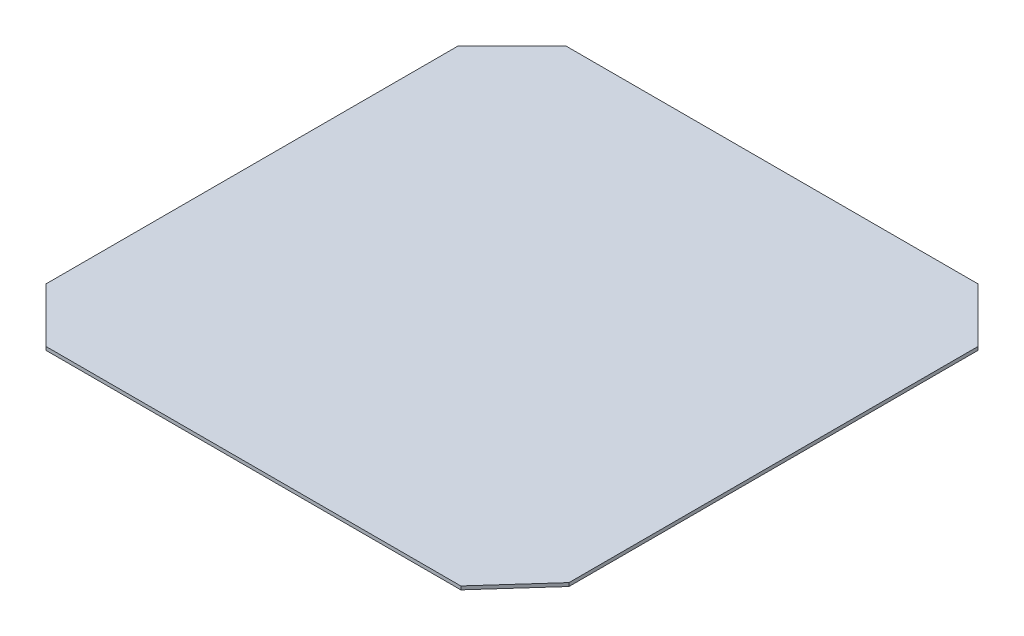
ISO-10303-21;
HEADER;
FILE_DESCRIPTION(('STEP AP214'),'2;1');
FILE_NAME('part.step','',(''),(''),'','','');
FILE_SCHEMA(('AUTOMOTIVE_DESIGN { 1 0 10303 214 1 1 1 1 }'));
ENDSEC;
DATA;
#1=APPLICATION_CONTEXT('core data for automotive mechanical design processes');
#2=APPLICATION_PROTOCOL_DEFINITION('international standard','automotive_design',2000,#1);
#3=PRODUCT_CONTEXT('',#1,'mechanical');
#4=PRODUCT('Part','Part','',(#3));
#5=PRODUCT_RELATED_PRODUCT_CATEGORY('part','',(#4));
#6=PRODUCT_DEFINITION_FORMATION('','',#4);
#7=PRODUCT_DEFINITION_CONTEXT('part definition',#1,'design');
#8=PRODUCT_DEFINITION('design','',#6,#7);
#9=PRODUCT_DEFINITION_SHAPE('','',#8);
#10=(LENGTH_UNIT() NAMED_UNIT(*) SI_UNIT(.MILLI.,.METRE.));
#11=(NAMED_UNIT(*) PLANE_ANGLE_UNIT() SI_UNIT($,.RADIAN.));
#12=(NAMED_UNIT(*) SI_UNIT($,.STERADIAN.) SOLID_ANGLE_UNIT());
#13=UNCERTAINTY_MEASURE_WITH_UNIT(LENGTH_MEASURE(1.E-05),#10,'distance_accuracy_value','');
#14=(GEOMETRIC_REPRESENTATION_CONTEXT(3) GLOBAL_UNCERTAINTY_ASSIGNED_CONTEXT((#13)) GLOBAL_UNIT_ASSIGNED_CONTEXT((#10,
#11,#12)) REPRESENTATION_CONTEXT('',''));
#15=CARTESIAN_POINT('',(0.,0.,0.));
#16=DIRECTION('',(0.,0.,1.));
#17=DIRECTION('',(1.,0.,0.));
#18=AXIS2_PLACEMENT_3D('',#15,#16,#17);
#19=CARTESIAN_POINT('',(244.787268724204,4.,304.8));
#20=DIRECTION('',(-0.743915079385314,0.,-0.668274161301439));
#21=DIRECTION('',(-0.668274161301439,0.,0.743915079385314));
#22=AXIS2_PLACEMENT_3D('',#19,#20,#21);
#23=PLANE('',#22);
#24=DIRECTION('',(0.668274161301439,0.,-0.743915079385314));
#25=VECTOR('',#24,1.);
#26=CARTESIAN_POINT('',(244.787268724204,0.,304.8));
#27=LINE('',#26,#25);
#28=CARTESIAN_POINT('',(244.787268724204,0.,304.8));
#29=VERTEX_POINT('',#28);
#30=CARTESIAN_POINT('',(304.8,0.,237.994520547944));
#31=VERTEX_POINT('',#30);
#32=EDGE_CURVE('E148',#29,#31,#27,.T.);
#33=ORIENTED_EDGE('',*,*,#32,.T.);
#34=DIRECTION('',(0.,-1.,0.));
#35=VECTOR('',#34,1.);
#36=CARTESIAN_POINT('',(304.8,4.,237.994520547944));
#37=LINE('',#36,#35);
#38=CARTESIAN_POINT('',(304.8,4.,237.994520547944));
#39=VERTEX_POINT('',#38);
#40=EDGE_CURVE('E11',#39,#31,#37,.T.);
#41=ORIENTED_EDGE('',*,*,#40,.F.);
#42=DIRECTION('',(0.668274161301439,0.,-0.743915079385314));
#43=VECTOR('',#42,1.);
#44=CARTESIAN_POINT('',(244.787268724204,4.,304.8));
#45=LINE('',#44,#43);
#46=CARTESIAN_POINT('',(244.787268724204,4.,304.8));
#47=VERTEX_POINT('',#46);
#48=EDGE_CURVE('E170',#47,#39,#45,.T.);
#49=ORIENTED_EDGE('',*,*,#48,.F.);
#50=DIRECTION('',(0.,-1.,0.));
#51=VECTOR('',#50,1.);
#52=CARTESIAN_POINT('',(244.787268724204,4.,304.8));
#53=LINE('',#52,#51);
#54=EDGE_CURVE('E144',#47,#29,#53,.T.);
#55=ORIENTED_EDGE('',*,*,#54,.T.);
#56=EDGE_LOOP('',(#33,#41,#49,#55));
#57=FACE_BOUND('',#56,.T.);
#58=ADVANCED_FACE('F47',(#57),#23,.F.);
#59=CARTESIAN_POINT('',(304.8,4.,237.994520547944));
#60=DIRECTION('',(-1.,0.,0.));
#61=DIRECTION('',(0.,0.,1.));
#62=AXIS2_PLACEMENT_3D('',#59,#60,#61);
#63=PLANE('',#62);
#64=DIRECTION('',(0.,0.,-1.));
#65=VECTOR('',#64,1.);
#66=CARTESIAN_POINT('',(304.8,0.,237.994520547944));
#67=LINE('',#66,#65);
#68=CARTESIAN_POINT('',(304.8,0.,-241.3));
#69=VERTEX_POINT('',#68);
#70=EDGE_CURVE('E152',#31,#69,#67,.T.);
#71=ORIENTED_EDGE('',*,*,#70,.T.);
#72=DIRECTION('',(0.,-1.,0.));
#73=VECTOR('',#72,1.);
#74=CARTESIAN_POINT('',(304.8,4.,-241.3));
#75=LINE('',#74,#73);
#76=CARTESIAN_POINT('',(304.8,4.,-241.3));
#77=VERTEX_POINT('',#76);
#78=EDGE_CURVE('E56',#77,#69,#75,.T.);
#79=ORIENTED_EDGE('',*,*,#78,.F.);
#80=DIRECTION('',(0.,0.,-1.));
#81=VECTOR('',#80,1.);
#82=CARTESIAN_POINT('',(304.8,4.,237.994520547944));
#83=LINE('',#82,#81);
#84=EDGE_CURVE('E107',#39,#77,#83,.T.);
#85=ORIENTED_EDGE('',*,*,#84,.F.);
#86=ORIENTED_EDGE('',*,*,#40,.T.);
#87=EDGE_LOOP('',(#71,#79,#85,#86));
#88=FACE_BOUND('',#87,.T.);
#89=ADVANCED_FACE('F216',(#88),#63,.F.);
#90=CARTESIAN_POINT('',(304.8,4.,-241.3));
#91=DIRECTION('',(-0.707106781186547,0.,0.707106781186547));
#92=DIRECTION('',(0.707106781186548,0.,0.707106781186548));
#93=AXIS2_PLACEMENT_3D('',#90,#91,#92);
#94=PLANE('',#93);
#95=DIRECTION('',(-0.707106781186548,0.,-0.707106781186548));
#96=VECTOR('',#95,1.);
#97=CARTESIAN_POINT('',(304.8,0.,-241.3));
#98=LINE('',#97,#96);
#99=CARTESIAN_POINT('',(241.3,0.,-304.8));
#100=VERTEX_POINT('',#99);
#101=EDGE_CURVE('E155',#69,#100,#98,.T.);
#102=ORIENTED_EDGE('',*,*,#101,.T.);
#103=DIRECTION('',(0.,-1.,0.));
#104=VECTOR('',#103,1.);
#105=CARTESIAN_POINT('',(241.3,4.,-304.8));
#106=LINE('',#105,#104);
#107=CARTESIAN_POINT('',(241.3,4.,-304.8));
#108=VERTEX_POINT('',#107);
#109=EDGE_CURVE('E181',#108,#100,#106,.T.);
#110=ORIENTED_EDGE('',*,*,#109,.F.);
#111=DIRECTION('',(-0.707106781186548,0.,-0.707106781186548));
#112=VECTOR('',#111,1.);
#113=CARTESIAN_POINT('',(304.8,4.,-241.3));
#114=LINE('',#113,#112);
#115=EDGE_CURVE('E191',#77,#108,#114,.T.);
#116=ORIENTED_EDGE('',*,*,#115,.F.);
#117=ORIENTED_EDGE('',*,*,#78,.T.);
#118=EDGE_LOOP('',(#102,#110,#116,#117));
#119=FACE_BOUND('',#118,.T.);
#120=ADVANCED_FACE('F189',(#119),#94,.F.);
#121=CARTESIAN_POINT('',(241.3,4.,-304.8));
#122=DIRECTION('',(0.,0.,1.));
#123=DIRECTION('',(1.,0.,0.));
#124=AXIS2_PLACEMENT_3D('',#121,#122,#123);
#125=PLANE('',#124);
#126=DIRECTION('',(-1.,0.,0.));
#127=VECTOR('',#126,1.);
#128=CARTESIAN_POINT('',(241.3,0.,-304.8));
#129=LINE('',#128,#127);
#130=CARTESIAN_POINT('',(-241.3,0.,-304.8));
#131=VERTEX_POINT('',#130);
#132=EDGE_CURVE('E158',#100,#131,#129,.T.);
#133=ORIENTED_EDGE('',*,*,#132,.T.);
#134=DIRECTION('',(0.,-1.,0.));
#135=VECTOR('',#134,1.);
#136=CARTESIAN_POINT('',(-241.3,4.,-304.8));
#137=LINE('',#136,#135);
#138=CARTESIAN_POINT('',(-241.3,4.,-304.8));
#139=VERTEX_POINT('',#138);
#140=EDGE_CURVE('E177',#139,#131,#137,.T.);
#141=ORIENTED_EDGE('',*,*,#140,.F.);
#142=DIRECTION('',(-1.,0.,0.));
#143=VECTOR('',#142,1.);
#144=CARTESIAN_POINT('',(241.3,4.,-304.8));
#145=LINE('',#144,#143);
#146=EDGE_CURVE('E204',#108,#139,#145,.T.);
#147=ORIENTED_EDGE('',*,*,#146,.F.);
#148=ORIENTED_EDGE('',*,*,#109,.T.);
#149=EDGE_LOOP('',(#133,#141,#147,#148));
#150=FACE_BOUND('',#149,.T.);
#151=ADVANCED_FACE('F199',(#150),#125,.F.);
#152=CARTESIAN_POINT('',(-241.3,4.,-304.8));
#153=DIRECTION('',(0.707106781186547,0.,0.707106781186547));
#154=DIRECTION('',(0.707106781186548,0.,-0.707106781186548));
#155=AXIS2_PLACEMENT_3D('',#152,#153,#154);
#156=PLANE('',#155);
#157=DIRECTION('',(-0.707106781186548,0.,0.707106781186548));
#158=VECTOR('',#157,1.);
#159=CARTESIAN_POINT('',(-241.3,0.,-304.8));
#160=LINE('',#159,#158);
#161=CARTESIAN_POINT('',(-304.8,0.,-241.3));
#162=VERTEX_POINT('',#161);
#163=EDGE_CURVE('E161',#131,#162,#160,.T.);
#164=ORIENTED_EDGE('',*,*,#163,.T.);
#165=DIRECTION('',(0.,-1.,0.));
#166=VECTOR('',#165,1.);
#167=CARTESIAN_POINT('',(-304.8,4.,-241.3));
#168=LINE('',#167,#166);
#169=CARTESIAN_POINT('',(-304.8,4.,-241.3));
#170=VERTEX_POINT('',#169);
#171=EDGE_CURVE('E137',#170,#162,#168,.T.);
#172=ORIENTED_EDGE('',*,*,#171,.F.);
#173=DIRECTION('',(-0.707106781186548,0.,0.707106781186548));
#174=VECTOR('',#173,1.);
#175=CARTESIAN_POINT('',(-241.3,4.,-304.8));
#176=LINE('',#175,#174);
#177=EDGE_CURVE('E126',#139,#170,#176,.T.);
#178=ORIENTED_EDGE('',*,*,#177,.F.);
#179=ORIENTED_EDGE('',*,*,#140,.T.);
#180=EDGE_LOOP('',(#164,#172,#178,#179));
#181=FACE_BOUND('',#180,.T.);
#182=ADVANCED_FACE('F202',(#181),#156,.F.);
#183=CARTESIAN_POINT('',(-304.8,4.,-241.3));
#184=DIRECTION('',(1.,0.,0.));
#185=DIRECTION('',(0.,0.,-1.));
#186=AXIS2_PLACEMENT_3D('',#183,#184,#185);
#187=PLANE('',#186);
#188=DIRECTION('',(0.,0.,1.));
#189=VECTOR('',#188,1.);
#190=CARTESIAN_POINT('',(-304.8,0.,-241.3));
#191=LINE('',#190,#189);
#192=CARTESIAN_POINT('',(-304.8,0.,241.3));
#193=VERTEX_POINT('',#192);
#194=EDGE_CURVE('E135',#162,#193,#191,.T.);
#195=ORIENTED_EDGE('',*,*,#194,.T.);
#196=DIRECTION('',(0.,-1.,0.));
#197=VECTOR('',#196,1.);
#198=CARTESIAN_POINT('',(-304.8,4.,241.3));
#199=LINE('',#198,#197);
#200=CARTESIAN_POINT('',(-304.8,4.,241.3));
#201=VERTEX_POINT('',#200);
#202=EDGE_CURVE('E132',#201,#193,#199,.T.);
#203=ORIENTED_EDGE('',*,*,#202,.F.);
#204=DIRECTION('',(0.,0.,1.));
#205=VECTOR('',#204,1.);
#206=CARTESIAN_POINT('',(-304.8,4.,-241.3));
#207=LINE('',#206,#205);
#208=EDGE_CURVE('E120',#170,#201,#207,.T.);
#209=ORIENTED_EDGE('',*,*,#208,.F.);
#210=ORIENTED_EDGE('',*,*,#171,.T.);
#211=EDGE_LOOP('',(#195,#203,#209,#210));
#212=FACE_BOUND('',#211,.T.);
#213=ADVANCED_FACE('F133',(#212),#187,.F.);
#214=CARTESIAN_POINT('',(-304.8,4.,241.3));
#215=DIRECTION('',(0.707106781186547,0.,-0.707106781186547));
#216=DIRECTION('',(-0.707106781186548,0.,-0.707106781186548));
#217=AXIS2_PLACEMENT_3D('',#214,#215,#216);
#218=PLANE('',#217);
#219=DIRECTION('',(0.707106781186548,0.,0.707106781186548));
#220=VECTOR('',#219,1.);
#221=CARTESIAN_POINT('',(-304.8,0.,241.3));
#222=LINE('',#221,#220);
#223=CARTESIAN_POINT('',(-241.3,0.,304.8));
#224=VERTEX_POINT('',#223);
#225=EDGE_CURVE('E93',#193,#224,#222,.T.);
#226=ORIENTED_EDGE('',*,*,#225,.T.);
#227=DIRECTION('',(0.,-1.,0.));
#228=VECTOR('',#227,1.);
#229=CARTESIAN_POINT('',(-241.3,4.,304.8));
#230=LINE('',#229,#228);
#231=CARTESIAN_POINT('',(-241.3,4.,304.8));
#232=VERTEX_POINT('',#231);
#233=EDGE_CURVE('E138',#232,#224,#230,.T.);
#234=ORIENTED_EDGE('',*,*,#233,.F.);
#235=DIRECTION('',(0.707106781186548,0.,0.707106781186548));
#236=VECTOR('',#235,1.);
#237=CARTESIAN_POINT('',(-304.8,4.,241.3));
#238=LINE('',#237,#236);
#239=EDGE_CURVE('E124',#201,#232,#238,.T.);
#240=ORIENTED_EDGE('',*,*,#239,.F.);
#241=ORIENTED_EDGE('',*,*,#202,.T.);
#242=EDGE_LOOP('',(#226,#234,#240,#241));
#243=FACE_BOUND('',#242,.T.);
#244=ADVANCED_FACE('F140',(#243),#218,.F.);
#245=CARTESIAN_POINT('',(-241.3,4.,304.8));
#246=DIRECTION('',(0.,0.,-1.));
#247=DIRECTION('',(-1.,0.,0.));
#248=AXIS2_PLACEMENT_3D('',#245,#246,#247);
#249=PLANE('',#248);
#250=DIRECTION('',(1.,0.,0.));
#251=VECTOR('',#250,1.);
#252=CARTESIAN_POINT('',(-241.3,0.,304.8));
#253=LINE('',#252,#251);
#254=EDGE_CURVE('E99',#224,#29,#253,.T.);
#255=ORIENTED_EDGE('',*,*,#254,.T.);
#256=ORIENTED_EDGE('',*,*,#54,.F.);
#257=DIRECTION('',(1.,0.,0.));
#258=VECTOR('',#257,1.);
#259=CARTESIAN_POINT('',(-241.3,4.,304.8));
#260=LINE('',#259,#258);
#261=EDGE_CURVE('E64',#232,#47,#260,.T.);
#262=ORIENTED_EDGE('',*,*,#261,.F.);
#263=ORIENTED_EDGE('',*,*,#233,.T.);
#264=EDGE_LOOP('',(#255,#256,#262,#263));
#265=FACE_BOUND('',#264,.T.);
#266=ADVANCED_FACE('F232',(#265),#249,.F.);
#267=CARTESIAN_POINT('',(0.,4.,0.));
#268=DIRECTION('',(0.,1.,0.));
#269=DIRECTION('',(0.,0.,1.));
#270=AXIS2_PLACEMENT_3D('',#267,#268,#269);
#271=PLANE('',#270);
#272=ORIENTED_EDGE('',*,*,#48,.T.);
#273=ORIENTED_EDGE('',*,*,#84,.T.);
#274=ORIENTED_EDGE('',*,*,#115,.T.);
#275=ORIENTED_EDGE('',*,*,#146,.T.);
#276=ORIENTED_EDGE('',*,*,#177,.T.);
#277=ORIENTED_EDGE('',*,*,#208,.T.);
#278=ORIENTED_EDGE('',*,*,#239,.T.);
#279=ORIENTED_EDGE('',*,*,#261,.T.);
#280=EDGE_LOOP('',(#272,#273,#274,#275,#276,#277,#278,#279));
#281=FACE_BOUND('',#280,.T.);
#282=ADVANCED_FACE('F122',(#281),#271,.T.);
#283=CARTESIAN_POINT('',(0.,0.,0.));
#284=DIRECTION('',(0.,1.,0.));
#285=DIRECTION('',(0.,0.,1.));
#286=AXIS2_PLACEMENT_3D('',#283,#284,#285);
#287=PLANE('',#286);
#288=ORIENTED_EDGE('',*,*,#32,.F.);
#289=ORIENTED_EDGE('',*,*,#254,.F.);
#290=ORIENTED_EDGE('',*,*,#225,.F.);
#291=ORIENTED_EDGE('',*,*,#194,.F.);
#292=ORIENTED_EDGE('',*,*,#163,.F.);
#293=ORIENTED_EDGE('',*,*,#132,.F.);
#294=ORIENTED_EDGE('',*,*,#101,.F.);
#295=ORIENTED_EDGE('',*,*,#70,.F.);
#296=EDGE_LOOP('',(#288,#289,#290,#291,#292,#293,#294,#295));
#297=FACE_BOUND('',#296,.T.);
#298=ADVANCED_FACE('F195',(#297),#287,.F.);
#299=CLOSED_SHELL('',(#58,#89,#120,#151,#182,#213,#244,#266,#282,#298));
#300=MANIFOLD_SOLID_BREP('B2',#299);
#301=ADVANCED_BREP_SHAPE_REPRESENTATION('',(#18,#300),#14);
#302=SHAPE_DEFINITION_REPRESENTATION(#9,#301);
ENDSEC;
END-ISO-10303-21;
